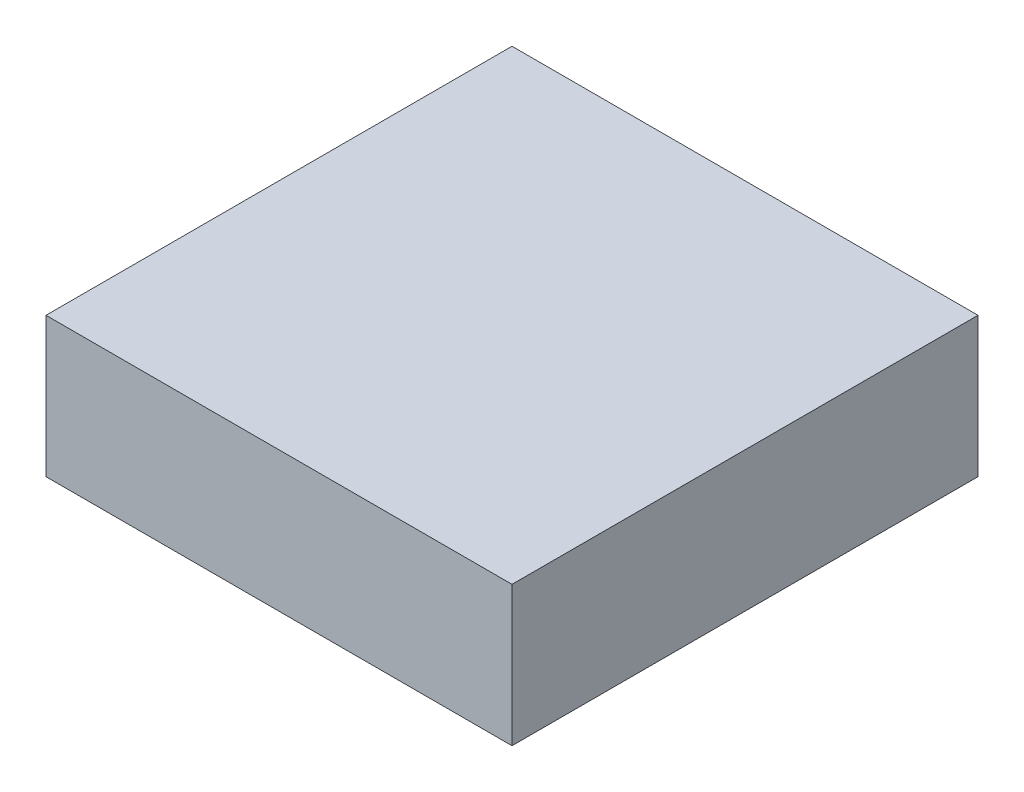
from build123d import *

# Parameters (mm, degrees)
SKETCH1_W      = 5
SKETCH1_H      = 1.5
EXTRUDE1_DEPTH = 5


with BuildPart() as part:
    # Sketch1 → Extrude1 (new body)
    with BuildSketch(Plane.XY):
        with Locations((0, 3.5)):
            Rectangle(SKETCH1_W, SKETCH1_H)
    extrude(amount=EXTRUDE1_DEPTH)


solid = part.part
